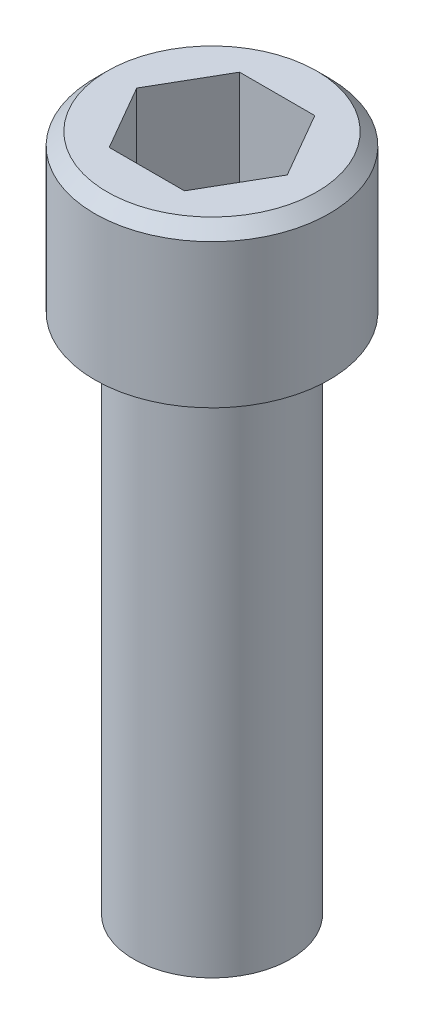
from build123d import *

# Parameters (mm, degrees)
CUT_EXTRUDE1_DEPTH = 6.35
CHAMFER1_SIZE      = 0.762


with BuildPart() as part:
    # Sketch1 → Base-Revolve (revolve)
    with BuildSketch(Plane.XY, mode=Mode.PRIVATE) as base_revolve_sk:
        Polygon((4.7625, 0), (7.14375, 0), (7.14375, 9.525), (0, 9.525), (0, -31.75), (4.7625, -31.75), align=None)
    revolve(base_revolve_sk.sketch.rotate(Axis((0, 0, 0), (0, 1, 0)), 90), axis=Axis((0, 0, 0), (0, 1, 0)))

    # Sketch2 → Cut-Extrude1 (cut)
    with BuildSketch(Plane(origin=(0, 9.525, 0), x_dir=(-1, 0, 0), z_dir=(0, 1, 0))):
        Polygon((2.291358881, -3.96875), (-2.291358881, -3.96875), (-4.582717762, 0), (-2.291358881, 3.96875), (2.291358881, 3.96875), (4.582717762, 0), align=None)
    extrude(amount=-CUT_EXTRUDE1_DEPTH, mode=Mode.SUBTRACT)

    # Chamfer1
    chamfer1_edges = [part.edges().sort_by_distance(p)[0] for p in [
        (0, 9.525, 7.14375),
    ]]
    chamfer(chamfer1_edges, length=CHAMFER1_SIZE)


solid = part.part
